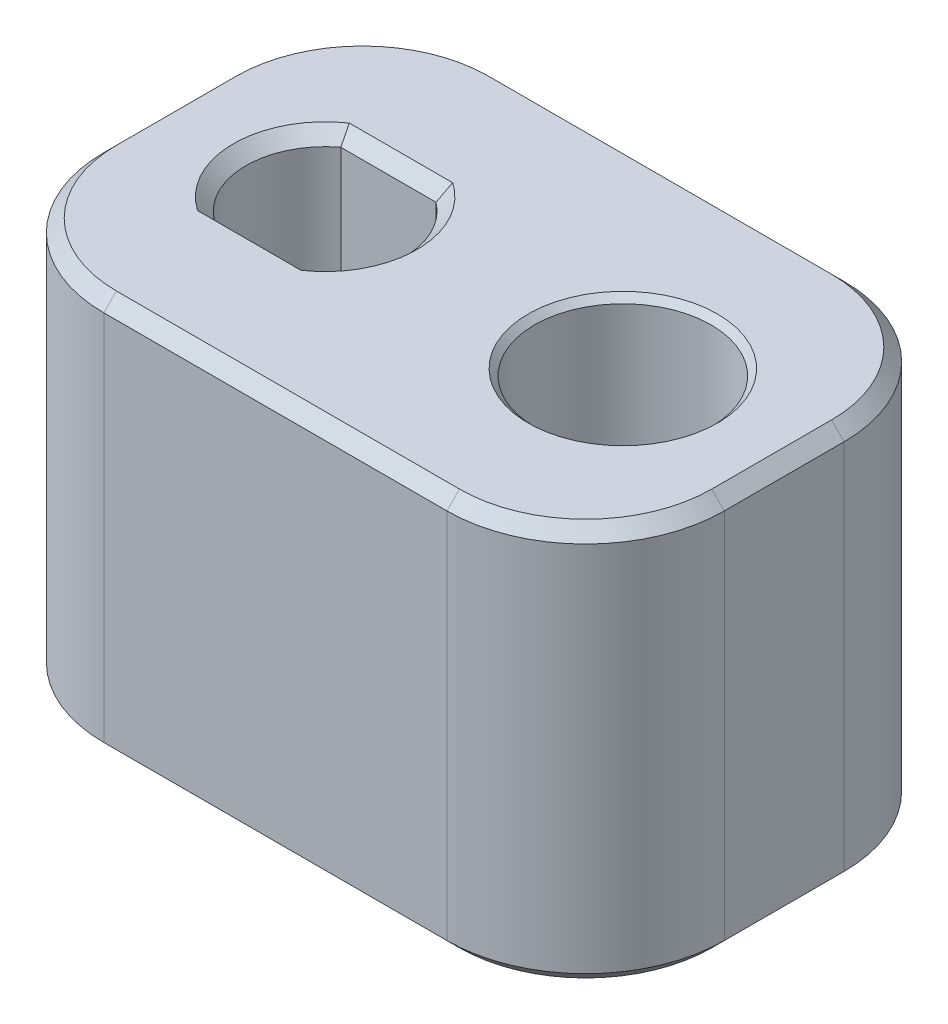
from build123d import *

# Parameters (mm, degrees)
SKETCH1_W      = 24.9936
SKETCH1_H      = 16.002
EXTRUDE1_DEPTH = 16.002
FILLET1_R      = 5.588
EXTRUDE2_DEPTH = 22.823153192
CHAMFER2_SIZE  = 0.508
CHAMFER1_SIZE  = 0.508


with BuildPart() as part:
    # Sketch1 → Extrude1 (new body)
    with BuildSketch(Plane(origin=(0, 0, 0), x_dir=(1, 0, 0), z_dir=(0, 1, 0))):
        Rectangle(SKETCH1_W, SKETCH1_H)
    extrude(amount=EXTRUDE1_DEPTH)

    # Fillet1
    fillet1_edges = [part.edges().sort_by_distance(p)[0] for p in [
        (12.4968, 8.001, 8.001),
        (-12.4968, 8.001, 8.001),
        (-12.4968, 8.001, -8.001),
        (12.4968, 8.001, -8.001),
    ]]
    fillet(fillet1_edges, radius=FILLET1_R)

    # Sketch4 → Extrude2 (cut, through all)
    with BuildSketch(Plane(origin=(0, 16.002, 0), x_dir=(1, 0, 0), z_dir=(0, 1, 0))):
        with BuildLine():
            Line((-7.912089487, 2.54635), (-4.076710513, 2.54635))
            ThreePointArc((-4.076710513, 2.54635), (-2.8067, 0), (-4.076710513, -2.54635))
            Line((-4.076710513, -2.54635), (-7.912089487, -2.54635))
            ThreePointArc((-7.912089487, -2.54635), (-9.1821, 0), (-7.912089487, 2.54635))
        make_face()
    extrude(amount=-EXTRUDE2_DEPTH, mode=Mode.SUBTRACT)

    # Chamfer2
    chamfer2_edges = [part.edges().sort_by_distance(p)[0] for p in [
        (-9.1821, 0, 0),
        (-5.9944, 0, -2.54635),
        (-2.8067, 0, 0),
        (-5.9944, 0, 2.54635),
        (-9.1821, 16.002, 0),
        (-5.9944, 16.002, 2.54635),
        (-2.8067, 16.002, 0),
        (-5.9944, 16.002, -2.54635),
    ]]
    chamfer(chamfer2_edges, length=CHAMFER2_SIZE)

    # Sketch3 → Cut-Revolve2 (revolve, cut)
    with BuildSketch(Plane.XY, mode=Mode.PRIVATE) as cut_revolve2_sk:
        Polygon((5.9944, 16.002), (2.1844, 16.002), (2.4384, 15.748), (2.4384, 7.112), (0.8382, 7.112), (0.8382, 0.508), (0.3302, 0), (5.9944, 0), align=None)
    revolve(cut_revolve2_sk.sketch.rotate(Axis((5.9944, -4.120405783, 0), (0, 1, 0)), 270), axis=Axis((5.9944, -4.120405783, 0), (0, 1, 0)), mode=Mode.SUBTRACT)

    # Chamfer1
    chamfer1_edges = [part.edges().sort_by_distance(p)[0] for p in [
        (-12.4968, 0, 0),
        (-12.4968, 16.002, 0),
        (12.4968, 0, 0),
        (0, 0, 8.001),
        (0, 0, -8.001),
        (10.860112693, 0, 6.364312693),
        (10.860112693, 0, -6.364312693),
        (-10.860112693, 0, 6.364312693),
        (-10.860112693, 0, -6.364312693),
        (0, 16.002, -8.001),
        (12.4968, 16.002, 0),
        (0, 16.002, 8.001),
        (10.860112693, 16.002, 6.364312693),
        (10.860112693, 16.002, -6.364312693),
        (-10.860112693, 16.002, 6.364312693),
        (-10.860112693, 16.002, -6.364312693),
    ]]
    chamfer(chamfer1_edges, length=CHAMFER1_SIZE)


solid = part.part
